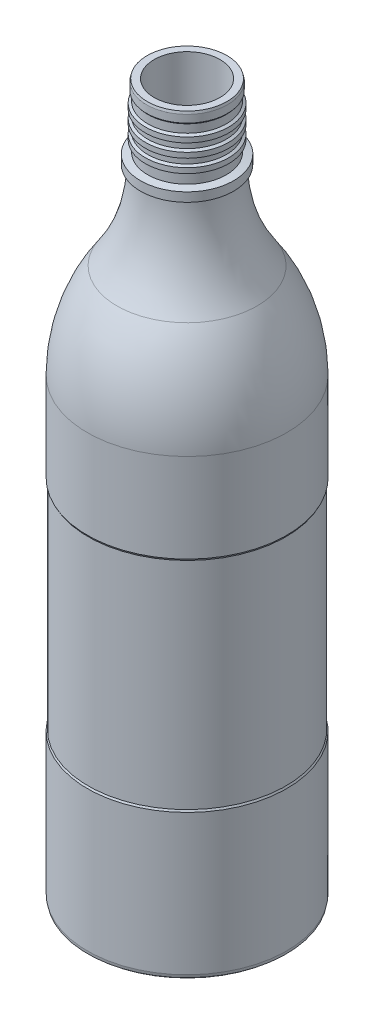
ISO-10303-21;
HEADER;
FILE_DESCRIPTION(('STEP AP214'),'2;1');
FILE_NAME('part.step','',(''),(''),'','','');
FILE_SCHEMA(('AUTOMOTIVE_DESIGN { 1 0 10303 214 1 1 1 1 }'));
ENDSEC;
DATA;
#1=APPLICATION_CONTEXT('core data for automotive mechanical design processes');
#2=APPLICATION_PROTOCOL_DEFINITION('international standard','automotive_design',2000,#1);
#3=PRODUCT_CONTEXT('',#1,'mechanical');
#4=PRODUCT('Part','Part','',(#3));
#5=PRODUCT_RELATED_PRODUCT_CATEGORY('part','',(#4));
#6=PRODUCT_DEFINITION_FORMATION('','',#4);
#7=PRODUCT_DEFINITION_CONTEXT('part definition',#1,'design');
#8=PRODUCT_DEFINITION('design','',#6,#7);
#9=PRODUCT_DEFINITION_SHAPE('','',#8);
#10=(LENGTH_UNIT() NAMED_UNIT(*) SI_UNIT(.MILLI.,.METRE.));
#11=(NAMED_UNIT(*) PLANE_ANGLE_UNIT() SI_UNIT($,.RADIAN.));
#12=(NAMED_UNIT(*) SI_UNIT($,.STERADIAN.) SOLID_ANGLE_UNIT());
#13=UNCERTAINTY_MEASURE_WITH_UNIT(LENGTH_MEASURE(1.E-05),#10,'distance_accuracy_value','');
#14=(GEOMETRIC_REPRESENTATION_CONTEXT(3) GLOBAL_UNCERTAINTY_ASSIGNED_CONTEXT((#13)) GLOBAL_UNIT_ASSIGNED_CONTEXT((#10,
#11,#12)) REPRESENTATION_CONTEXT('',''));
#15=CARTESIAN_POINT('',(0.,0.,0.));
#16=DIRECTION('',(0.,0.,1.));
#17=DIRECTION('',(1.,0.,0.));
#18=AXIS2_PLACEMENT_3D('',#15,#16,#17);
#19=CARTESIAN_POINT('',(0.,8.,0.));
#20=DIRECTION('',(0.,-1.,0.));
#21=DIRECTION('',(0.,0.,-1.));
#22=AXIS2_PLACEMENT_3D('',#19,#20,#21);
#23=PLANE('',#22);
#24=CARTESIAN_POINT('',(0.,8.,0.));
#25=DIRECTION('',(0.,-1.,0.));
#26=DIRECTION('',(0.,0.,-1.));
#27=AXIS2_PLACEMENT_3D('',#24,#25,#26);
#28=CIRCLE('',#27,21.);
#29=CARTESIAN_POINT('',(0.,8.,-21.));
#30=VERTEX_POINT('',#29);
#31=EDGE_CURVE('E10',#30,#30,#28,.T.);
#32=ORIENTED_EDGE('',*,*,#31,.T.);
#33=EDGE_LOOP('',(#32));
#34=FACE_BOUND('',#33,.T.);
#35=ADVANCED_FACE('F37',(#34),#23,.T.);
#36=CARTESIAN_POINT('',(0.,8.,0.));
#37=DIRECTION('',(0.,-1.,0.));
#38=DIRECTION('',(0.,0.,-1.));
#39=AXIS2_PLACEMENT_3D('',#36,#37,#38);
#40=CONICAL_SURFACE('',#39,21.,1.40101805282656);
#41=CARTESIAN_POINT('',(0.,7.4,0.));
#42=DIRECTION('',(0.,-1.,0.));
#43=DIRECTION('',(0.,0.,-1.));
#44=AXIS2_PLACEMENT_3D('',#41,#42,#43);
#45=CIRCLE('',#44,24.5);
#46=CARTESIAN_POINT('',(0.,7.4,-24.5));
#47=VERTEX_POINT('',#46);
#48=EDGE_CURVE('E43',#47,#47,#45,.T.);
#49=ORIENTED_EDGE('',*,*,#48,.T.);
#50=EDGE_LOOP('',(#49));
#51=FACE_BOUND('',#50,.T.);
#52=ORIENTED_EDGE('',*,*,#31,.F.);
#53=EDGE_LOOP('',(#52));
#54=FACE_BOUND('',#53,.T.);
#55=ADVANCED_FACE('F198',(#51,#54),#40,.F.);
#56=CARTESIAN_POINT('',(0.,7.4,0.));
#57=DIRECTION('',(0.,-1.,0.));
#58=DIRECTION('',(0.,0.,-1.));
#59=AXIS2_PLACEMENT_3D('',#56,#57,#58);
#60=CONICAL_SURFACE('',#59,24.5,0.896055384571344);
#61=CARTESIAN_POINT('',(0.,5.,0.));
#62=DIRECTION('',(0.,-1.,0.));
#63=DIRECTION('',(0.,0.,-1.));
#64=AXIS2_PLACEMENT_3D('',#61,#62,#63);
#65=CIRCLE('',#64,27.5);
#66=CARTESIAN_POINT('',(0.,5.,-27.5));
#67=VERTEX_POINT('',#66);
#68=EDGE_CURVE('E47',#67,#67,#65,.T.);
#69=ORIENTED_EDGE('',*,*,#68,.T.);
#70=EDGE_LOOP('',(#69));
#71=FACE_BOUND('',#70,.T.);
#72=ORIENTED_EDGE('',*,*,#48,.F.);
#73=EDGE_LOOP('',(#72));
#74=FACE_BOUND('',#73,.T.);
#75=ADVANCED_FACE('F202',(#71,#74),#60,.F.);
#76=CARTESIAN_POINT('',(0.,5.,0.));
#77=DIRECTION('',(0.,-1.,0.));
#78=DIRECTION('',(0.,0.,-1.));
#79=AXIS2_PLACEMENT_3D('',#76,#77,#78);
#80=CONICAL_SURFACE('',#79,27.5,0.375960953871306);
#81=CARTESIAN_POINT('',(0.,1.2,0.));
#82=DIRECTION('',(0.,-1.,0.));
#83=DIRECTION('',(0.,0.,-1.));
#84=AXIS2_PLACEMENT_3D('',#81,#82,#83);
#85=CIRCLE('',#84,29.);
#86=CARTESIAN_POINT('',(0.,1.2,-29.));
#87=VERTEX_POINT('',#86);
#88=EDGE_CURVE('E51',#87,#87,#85,.T.);
#89=ORIENTED_EDGE('',*,*,#88,.T.);
#90=EDGE_LOOP('',(#89));
#91=FACE_BOUND('',#90,.T.);
#92=ORIENTED_EDGE('',*,*,#68,.F.);
#93=EDGE_LOOP('',(#92));
#94=FACE_BOUND('',#93,.T.);
#95=ADVANCED_FACE('F206',(#91,#94),#80,.F.);
#96=CARTESIAN_POINT('',(0.,1.2,0.));
#97=DIRECTION('',(0.,-1.,0.));
#98=DIRECTION('',(0.,0.,-1.));
#99=AXIS2_PLACEMENT_3D('',#96,#97,#98);
#100=CONICAL_SURFACE('',#99,29.,0.896055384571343);
#101=CARTESIAN_POINT('',(0.,0.,0.));
#102=DIRECTION('',(0.,-1.,0.));
#103=DIRECTION('',(0.,0.,-1.));
#104=AXIS2_PLACEMENT_3D('',#101,#102,#103);
#105=CIRCLE('',#104,30.5);
#106=CARTESIAN_POINT('',(0.,0.,-30.5));
#107=VERTEX_POINT('',#106);
#108=EDGE_CURVE('E56',#107,#107,#105,.T.);
#109=ORIENTED_EDGE('',*,*,#108,.T.);
#110=EDGE_LOOP('',(#109));
#111=FACE_BOUND('',#110,.T.);
#112=ORIENTED_EDGE('',*,*,#88,.F.);
#113=EDGE_LOOP('',(#112));
#114=FACE_BOUND('',#113,.T.);
#115=ADVANCED_FACE('F213',(#111,#114),#100,.F.);
#116=CARTESIAN_POINT('',(30.5,0.,0.));
#117=DIRECTION('',(0.,-1.,0.));
#118=DIRECTION('',(0.,0.,-1.));
#119=AXIS2_PLACEMENT_3D('',#116,#117,#118);
#120=PLANE('',#119);
#121=CARTESIAN_POINT('',(0.,0.,0.));
#122=DIRECTION('',(0.,-1.,0.));
#123=DIRECTION('',(0.,0.,-1.));
#124=AXIS2_PLACEMENT_3D('',#121,#122,#123);
#125=CIRCLE('',#124,32.2);
#126=CARTESIAN_POINT('',(0.,0.,-32.2));
#127=VERTEX_POINT('',#126);
#128=EDGE_CURVE('E59',#127,#127,#125,.T.);
#129=ORIENTED_EDGE('',*,*,#128,.T.);
#130=EDGE_LOOP('',(#129));
#131=FACE_BOUND('',#130,.T.);
#132=ORIENTED_EDGE('',*,*,#108,.F.);
#133=EDGE_LOOP('',(#132));
#134=FACE_BOUND('',#133,.T.);
#135=ADVANCED_FACE('F217',(#131,#134),#120,.T.);
#136=CARTESIAN_POINT('',(0.,0.,0.));
#137=DIRECTION('',(0.,1.,0.));
#138=DIRECTION('',(0.,0.,1.));
#139=AXIS2_PLACEMENT_3D('',#136,#137,#138);
#140=CONICAL_SURFACE('',#139,32.2,0.87605805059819);
#141=CARTESIAN_POINT('',(0.,0.5,0.));
#142=DIRECTION('',(0.,-1.,0.));
#143=DIRECTION('',(0.,0.,-1.));
#144=AXIS2_PLACEMENT_3D('',#141,#142,#143);
#145=CIRCLE('',#144,32.8);
#146=CARTESIAN_POINT('',(0.,0.5,-32.8));
#147=VERTEX_POINT('',#146);
#148=EDGE_CURVE('E62',#147,#147,#145,.T.);
#149=ORIENTED_EDGE('',*,*,#148,.T.);
#150=EDGE_LOOP('',(#149));
#151=FACE_BOUND('',#150,.T.);
#152=ORIENTED_EDGE('',*,*,#128,.F.);
#153=EDGE_LOOP('',(#152));
#154=FACE_BOUND('',#153,.T.);
#155=ADVANCED_FACE('F221',(#151,#154),#140,.T.);
#156=CARTESIAN_POINT('',(0.,0.5,0.));
#157=DIRECTION('',(0.,1.,0.));
#158=DIRECTION('',(0.,0.,1.));
#159=AXIS2_PLACEMENT_3D('',#156,#157,#158);
#160=CONICAL_SURFACE('',#159,32.8,0.197395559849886);
#161=CARTESIAN_POINT('',(0.,1.5,0.));
#162=DIRECTION('',(0.,-1.,0.));
#163=DIRECTION('',(0.,0.,-1.));
#164=AXIS2_PLACEMENT_3D('',#161,#162,#163);
#165=CIRCLE('',#164,33.);
#166=CARTESIAN_POINT('',(0.,1.5,-33.));
#167=VERTEX_POINT('',#166);
#168=EDGE_CURVE('E65',#167,#167,#165,.T.);
#169=ORIENTED_EDGE('',*,*,#168,.T.);
#170=EDGE_LOOP('',(#169));
#171=FACE_BOUND('',#170,.T.);
#172=ORIENTED_EDGE('',*,*,#148,.F.);
#173=EDGE_LOOP('',(#172));
#174=FACE_BOUND('',#173,.T.);
#175=ADVANCED_FACE('F225',(#171,#174),#160,.T.);
#176=CARTESIAN_POINT('',(0.,-10.,0.));
#177=DIRECTION('',(0.,-1.,0.));
#178=DIRECTION('',(0.,0.,-1.));
#179=AXIS2_PLACEMENT_3D('',#176,#177,#178);
#180=CYLINDRICAL_SURFACE('',#179,33.);
#181=CARTESIAN_POINT('',(0.,48.,0.));
#182=DIRECTION('',(0.,-1.,0.));
#183=DIRECTION('',(0.,0.,-1.));
#184=AXIS2_PLACEMENT_3D('',#181,#182,#183);
#185=CIRCLE('',#184,33.);
#186=CARTESIAN_POINT('',(0.,48.,-33.));
#187=VERTEX_POINT('',#186);
#188=EDGE_CURVE('E68',#187,#187,#185,.T.);
#189=ORIENTED_EDGE('',*,*,#188,.T.);
#190=EDGE_LOOP('',(#189));
#191=FACE_BOUND('',#190,.T.);
#192=ORIENTED_EDGE('',*,*,#168,.F.);
#193=EDGE_LOOP('',(#192));
#194=FACE_BOUND('',#193,.T.);
#195=ADVANCED_FACE('F229',(#191,#194),#180,.T.);
#196=CARTESIAN_POINT('',(0.,48.,0.));
#197=DIRECTION('',(0.,-1.,0.));
#198=DIRECTION('',(0.,0.,-1.));
#199=AXIS2_PLACEMENT_3D('',#196,#197,#198);
#200=CONICAL_SURFACE('',#199,33.,0.463647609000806);
#201=CARTESIAN_POINT('',(0.,48.6,0.));
#202=DIRECTION('',(0.,-1.,0.));
#203=DIRECTION('',(0.,0.,-1.));
#204=AXIS2_PLACEMENT_3D('',#201,#202,#203);
#205=CIRCLE('',#204,32.7);
#206=CARTESIAN_POINT('',(0.,48.6,-32.7));
#207=VERTEX_POINT('',#206);
#208=EDGE_CURVE('E71',#207,#207,#205,.T.);
#209=ORIENTED_EDGE('',*,*,#208,.T.);
#210=EDGE_LOOP('',(#209));
#211=FACE_BOUND('',#210,.T.);
#212=ORIENTED_EDGE('',*,*,#188,.F.);
#213=EDGE_LOOP('',(#212));
#214=FACE_BOUND('',#213,.T.);
#215=ADVANCED_FACE('F233',(#211,#214),#200,.T.);
#216=CARTESIAN_POINT('',(0.,-10.,0.));
#217=DIRECTION('',(0.,-1.,0.));
#218=DIRECTION('',(0.,0.,-1.));
#219=AXIS2_PLACEMENT_3D('',#216,#217,#218);
#220=CYLINDRICAL_SURFACE('',#219,32.7);
#221=CARTESIAN_POINT('',(0.,120.,0.));
#222=DIRECTION('',(0.,-1.,0.));
#223=DIRECTION('',(0.,0.,-1.));
#224=AXIS2_PLACEMENT_3D('',#221,#222,#223);
#225=CIRCLE('',#224,32.7);
#226=CARTESIAN_POINT('',(0.,120.,-32.7));
#227=VERTEX_POINT('',#226);
#228=EDGE_CURVE('E74',#227,#227,#225,.T.);
#229=ORIENTED_EDGE('',*,*,#228,.T.);
#230=EDGE_LOOP('',(#229));
#231=FACE_BOUND('',#230,.T.);
#232=ORIENTED_EDGE('',*,*,#208,.F.);
#233=EDGE_LOOP('',(#232));
#234=FACE_BOUND('',#233,.T.);
#235=ADVANCED_FACE('F237',(#231,#234),#220,.T.);
#236=CARTESIAN_POINT('',(0.,120.,0.));
#237=DIRECTION('',(0.,1.,0.));
#238=DIRECTION('',(0.,0.,1.));
#239=AXIS2_PLACEMENT_3D('',#236,#237,#238);
#240=CONICAL_SURFACE('',#239,32.7,0.463647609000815);
#241=CARTESIAN_POINT('',(0.,120.6,0.));
#242=DIRECTION('',(0.,-1.,0.));
#243=DIRECTION('',(0.,0.,-1.));
#244=AXIS2_PLACEMENT_3D('',#241,#242,#243);
#245=CIRCLE('',#244,33.);
#246=CARTESIAN_POINT('',(0.,120.6,-33.));
#247=VERTEX_POINT('',#246);
#248=EDGE_CURVE('E77',#247,#247,#245,.T.);
#249=ORIENTED_EDGE('',*,*,#248,.T.);
#250=EDGE_LOOP('',(#249));
#251=FACE_BOUND('',#250,.T.);
#252=ORIENTED_EDGE('',*,*,#228,.F.);
#253=EDGE_LOOP('',(#252));
#254=FACE_BOUND('',#253,.T.);
#255=ADVANCED_FACE('F241',(#251,#254),#240,.T.);
#256=CARTESIAN_POINT('',(0.,-10.,0.));
#257=DIRECTION('',(0.,-1.,0.));
#258=DIRECTION('',(0.,0.,-1.));
#259=AXIS2_PLACEMENT_3D('',#256,#257,#258);
#260=CYLINDRICAL_SURFACE('',#259,33.);
#261=CARTESIAN_POINT('',(0.,150.,0.));
#262=DIRECTION('',(0.,-1.,0.));
#263=DIRECTION('',(0.,0.,-1.));
#264=AXIS2_PLACEMENT_3D('',#261,#262,#263);
#265=CIRCLE('',#264,33.);
#266=CARTESIAN_POINT('',(0.,150.,-33.));
#267=VERTEX_POINT('',#266);
#268=EDGE_CURVE('E80',#267,#267,#265,.T.);
#269=ORIENTED_EDGE('',*,*,#268,.T.);
#270=EDGE_LOOP('',(#269));
#271=FACE_BOUND('',#270,.T.);
#272=ORIENTED_EDGE('',*,*,#248,.F.);
#273=EDGE_LOOP('',(#272));
#274=FACE_BOUND('',#273,.T.);
#275=ADVANCED_FACE('F245',(#271,#274),#260,.T.);
#276=CARTESIAN_POINT('',(0.,150.,0.));
#277=DIRECTION('',(0.,-1.,0.));
#278=DIRECTION('',(0.,0.,-1.));
#279=AXIS2_PLACEMENT_3D('',#276,#277,#278);
#280=DEGENERATE_TOROIDAL_SURFACE('',#279,22.,55.,.F.);
#281=CARTESIAN_POINT('',(0.,181.385325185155,0.));
#282=DIRECTION('',(0.,-1.,0.));
#283=DIRECTION('',(0.,0.,-1.));
#284=AXIS2_PLACEMENT_3D('',#281,#282,#283);
#285=CIRCLE('',#284,23.1659314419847);
#286=CARTESIAN_POINT('',(0.,181.385325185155,-23.1659314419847));
#287=VERTEX_POINT('',#286);
#288=EDGE_CURVE('E83',#287,#287,#285,.T.);
#289=ORIENTED_EDGE('',*,*,#288,.T.);
#290=EDGE_LOOP('',(#289));
#291=FACE_BOUND('',#290,.T.);
#292=ORIENTED_EDGE('',*,*,#268,.F.);
#293=EDGE_LOOP('',(#292));
#294=FACE_BOUND('',#293,.T.);
#295=ADVANCED_FACE('F249',(#291,#294),#280,.F.);
#296=CARTESIAN_POINT('',(0.,210.,0.));
#297=DIRECTION('',(0.,-1.,0.));
#298=DIRECTION('',(0.,0.,-1.));
#299=AXIS2_PLACEMENT_3D('',#296,#297,#298);
#300=TOROIDAL_SURFACE('',#299,64.3446808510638,50.1446808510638);
#301=CARTESIAN_POINT('',(0.,210.,0.));
#302=DIRECTION('',(0.,-1.,0.));
#303=DIRECTION('',(0.,0.,-1.));
#304=AXIS2_PLACEMENT_3D('',#301,#302,#303);
#305=CIRCLE('',#304,14.2);
#306=CARTESIAN_POINT('',(0.,210.,-14.2));
#307=VERTEX_POINT('',#306);
#308=EDGE_CURVE('E86',#307,#307,#305,.T.);
#309=ORIENTED_EDGE('',*,*,#308,.T.);
#310=EDGE_LOOP('',(#309));
#311=FACE_BOUND('',#310,.T.);
#312=ORIENTED_EDGE('',*,*,#288,.F.);
#313=EDGE_LOOP('',(#312));
#314=FACE_BOUND('',#313,.T.);
#315=ADVANCED_FACE('F253',(#311,#314),#300,.F.);
#316=CARTESIAN_POINT('',(0.,210.,0.));
#317=DIRECTION('',(0.,1.,0.));
#318=DIRECTION('',(0.,0.,1.));
#319=AXIS2_PLACEMENT_3D('',#316,#317,#318);
#320=CONICAL_SURFACE('',#319,14.2,1.24904577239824);
#321=CARTESIAN_POINT('',(0.,210.4,0.));
#322=DIRECTION('',(0.,-1.,0.));
#323=DIRECTION('',(0.,0.,-1.));
#324=AXIS2_PLACEMENT_3D('',#321,#322,#323);
#325=CIRCLE('',#324,15.4);
#326=CARTESIAN_POINT('',(0.,210.4,-15.4));
#327=VERTEX_POINT('',#326);
#328=EDGE_CURVE('E89',#327,#327,#325,.T.);
#329=ORIENTED_EDGE('',*,*,#328,.T.);
#330=EDGE_LOOP('',(#329));
#331=FACE_BOUND('',#330,.T.);
#332=ORIENTED_EDGE('',*,*,#308,.F.);
#333=EDGE_LOOP('',(#332));
#334=FACE_BOUND('',#333,.T.);
#335=ADVANCED_FACE('F257',(#331,#334),#320,.T.);
#336=CARTESIAN_POINT('',(0.,-10.,0.));
#337=DIRECTION('',(0.,-1.,0.));
#338=DIRECTION('',(0.,0.,-1.));
#339=AXIS2_PLACEMENT_3D('',#336,#337,#338);
#340=CYLINDRICAL_SURFACE('',#339,15.4);
#341=CARTESIAN_POINT('',(0.,213.4,0.));
#342=DIRECTION('',(0.,-1.,0.));
#343=DIRECTION('',(0.,0.,-1.));
#344=AXIS2_PLACEMENT_3D('',#341,#342,#343);
#345=CIRCLE('',#344,15.4);
#346=CARTESIAN_POINT('',(0.,213.4,-15.4));
#347=VERTEX_POINT('',#346);
#348=EDGE_CURVE('E92',#347,#347,#345,.T.);
#349=ORIENTED_EDGE('',*,*,#348,.T.);
#350=EDGE_LOOP('',(#349));
#351=FACE_BOUND('',#350,.T.);
#352=ORIENTED_EDGE('',*,*,#328,.F.);
#353=EDGE_LOOP('',(#352));
#354=FACE_BOUND('',#353,.T.);
#355=ADVANCED_FACE('F261',(#351,#354),#340,.T.);
#356=CARTESIAN_POINT('',(0.,213.4,0.));
#357=DIRECTION('',(0.,-1.,0.));
#358=DIRECTION('',(0.,0.,-1.));
#359=AXIS2_PLACEMENT_3D('',#356,#357,#358);
#360=CONICAL_SURFACE('',#359,15.4,1.36540093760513);
#361=CARTESIAN_POINT('',(0.,213.9,0.));
#362=DIRECTION('',(0.,-1.,0.));
#363=DIRECTION('',(0.,0.,-1.));
#364=AXIS2_PLACEMENT_3D('',#361,#362,#363);
#365=CIRCLE('',#364,13.);
#366=CARTESIAN_POINT('',(0.,213.9,-13.));
#367=VERTEX_POINT('',#366);
#368=EDGE_CURVE('E95',#367,#367,#365,.T.);
#369=ORIENTED_EDGE('',*,*,#368,.T.);
#370=EDGE_LOOP('',(#369));
#371=FACE_BOUND('',#370,.T.);
#372=ORIENTED_EDGE('',*,*,#348,.F.);
#373=EDGE_LOOP('',(#372));
#374=FACE_BOUND('',#373,.T.);
#375=ADVANCED_FACE('F265',(#371,#374),#360,.T.);
#376=CARTESIAN_POINT('',(0.,-10.,0.));
#377=DIRECTION('',(0.,-1.,0.));
#378=DIRECTION('',(0.,0.,-1.));
#379=AXIS2_PLACEMENT_3D('',#376,#377,#378);
#380=CYLINDRICAL_SURFACE('',#379,13.);
#381=CARTESIAN_POINT('',(0.,217.,0.));
#382=DIRECTION('',(0.,-1.,0.));
#383=DIRECTION('',(0.,0.,-1.));
#384=AXIS2_PLACEMENT_3D('',#381,#382,#383);
#385=CIRCLE('',#384,13.);
#386=CARTESIAN_POINT('',(0.,217.,-13.));
#387=VERTEX_POINT('',#386);
#388=EDGE_CURVE('E98',#387,#387,#385,.T.);
#389=ORIENTED_EDGE('',*,*,#388,.T.);
#390=EDGE_LOOP('',(#389));
#391=FACE_BOUND('',#390,.T.);
#392=ORIENTED_EDGE('',*,*,#368,.F.);
#393=EDGE_LOOP('',(#392));
#394=FACE_BOUND('',#393,.T.);
#395=ADVANCED_FACE('F269',(#391,#394),#380,.T.);
#396=CARTESIAN_POINT('',(0.,217.,0.));
#397=DIRECTION('',(0.,1.,0.));
#398=DIRECTION('',(0.,0.,1.));
#399=AXIS2_PLACEMENT_3D('',#396,#397,#398);
#400=CONICAL_SURFACE('',#399,13.,1.01219701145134);
#401=CARTESIAN_POINT('',(0.,217.5,0.));
#402=DIRECTION('',(0.,-1.,0.));
#403=DIRECTION('',(0.,0.,-1.));
#404=AXIS2_PLACEMENT_3D('',#401,#402,#403);
#405=CIRCLE('',#404,13.8);
#406=CARTESIAN_POINT('',(0.,217.5,-13.8));
#407=VERTEX_POINT('',#406);
#408=EDGE_CURVE('E101',#407,#407,#405,.T.);
#409=ORIENTED_EDGE('',*,*,#408,.T.);
#410=EDGE_LOOP('',(#409));
#411=FACE_BOUND('',#410,.T.);
#412=ORIENTED_EDGE('',*,*,#388,.F.);
#413=EDGE_LOOP('',(#412));
#414=FACE_BOUND('',#413,.T.);
#415=ADVANCED_FACE('F273',(#411,#414),#400,.T.);
#416=CARTESIAN_POINT('',(0.,-10.,0.));
#417=DIRECTION('',(0.,-1.,0.));
#418=DIRECTION('',(0.,0.,-1.));
#419=AXIS2_PLACEMENT_3D('',#416,#417,#418);
#420=CYLINDRICAL_SURFACE('',#419,13.8);
#421=CARTESIAN_POINT('',(0.,219.2,0.));
#422=DIRECTION('',(0.,-1.,0.));
#423=DIRECTION('',(0.,0.,-1.));
#424=AXIS2_PLACEMENT_3D('',#421,#422,#423);
#425=CIRCLE('',#424,13.8);
#426=CARTESIAN_POINT('',(0.,219.2,-13.8));
#427=VERTEX_POINT('',#426);
#428=EDGE_CURVE('E104',#427,#427,#425,.T.);
#429=ORIENTED_EDGE('',*,*,#428,.T.);
#430=EDGE_LOOP('',(#429));
#431=FACE_BOUND('',#430,.T.);
#432=ORIENTED_EDGE('',*,*,#408,.F.);
#433=EDGE_LOOP('',(#432));
#434=FACE_BOUND('',#433,.T.);
#435=ADVANCED_FACE('F277',(#431,#434),#420,.T.);
#436=CARTESIAN_POINT('',(0.,219.2,0.));
#437=DIRECTION('',(0.,-1.,0.));
#438=DIRECTION('',(0.,0.,-1.));
#439=AXIS2_PLACEMENT_3D('',#436,#437,#438);
#440=CONICAL_SURFACE('',#439,13.8,1.01219701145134);
#441=CARTESIAN_POINT('',(0.,219.7,0.));
#442=DIRECTION('',(0.,-1.,0.));
#443=DIRECTION('',(0.,0.,-1.));
#444=AXIS2_PLACEMENT_3D('',#441,#442,#443);
#445=CIRCLE('',#444,13.);
#446=CARTESIAN_POINT('',(0.,219.7,-13.));
#447=VERTEX_POINT('',#446);
#448=EDGE_CURVE('E107',#447,#447,#445,.T.);
#449=ORIENTED_EDGE('',*,*,#448,.T.);
#450=EDGE_LOOP('',(#449));
#451=FACE_BOUND('',#450,.T.);
#452=ORIENTED_EDGE('',*,*,#428,.F.);
#453=EDGE_LOOP('',(#452));
#454=FACE_BOUND('',#453,.T.);
#455=ADVANCED_FACE('F281',(#451,#454),#440,.T.);
#456=CARTESIAN_POINT('',(0.,-10.,0.));
#457=DIRECTION('',(0.,-1.,0.));
#458=DIRECTION('',(0.,0.,-1.));
#459=AXIS2_PLACEMENT_3D('',#456,#457,#458);
#460=CYLINDRICAL_SURFACE('',#459,13.);
#461=CARTESIAN_POINT('',(0.,221.4,0.));
#462=DIRECTION('',(0.,-1.,0.));
#463=DIRECTION('',(0.,0.,-1.));
#464=AXIS2_PLACEMENT_3D('',#461,#462,#463);
#465=CIRCLE('',#464,13.);
#466=CARTESIAN_POINT('',(0.,221.4,-13.));
#467=VERTEX_POINT('',#466);
#468=EDGE_CURVE('E110',#467,#467,#465,.T.);
#469=ORIENTED_EDGE('',*,*,#468,.T.);
#470=EDGE_LOOP('',(#469));
#471=FACE_BOUND('',#470,.T.);
#472=ORIENTED_EDGE('',*,*,#448,.F.);
#473=EDGE_LOOP('',(#472));
#474=FACE_BOUND('',#473,.T.);
#475=ADVANCED_FACE('F285',(#471,#474),#460,.T.);
#476=CARTESIAN_POINT('',(0.,221.4,0.));
#477=DIRECTION('',(0.,1.,0.));
#478=DIRECTION('',(0.,0.,1.));
#479=AXIS2_PLACEMENT_3D('',#476,#477,#478);
#480=CONICAL_SURFACE('',#479,13.,1.01219701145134);
#481=CARTESIAN_POINT('',(0.,221.9,0.));
#482=DIRECTION('',(0.,-1.,0.));
#483=DIRECTION('',(0.,0.,-1.));
#484=AXIS2_PLACEMENT_3D('',#481,#482,#483);
#485=CIRCLE('',#484,13.8);
#486=CARTESIAN_POINT('',(0.,221.9,-13.8));
#487=VERTEX_POINT('',#486);
#488=EDGE_CURVE('E113',#487,#487,#485,.T.);
#489=ORIENTED_EDGE('',*,*,#488,.T.);
#490=EDGE_LOOP('',(#489));
#491=FACE_BOUND('',#490,.T.);
#492=ORIENTED_EDGE('',*,*,#468,.F.);
#493=EDGE_LOOP('',(#492));
#494=FACE_BOUND('',#493,.T.);
#495=ADVANCED_FACE('F289',(#491,#494),#480,.T.);
#496=CARTESIAN_POINT('',(0.,-10.,0.));
#497=DIRECTION('',(0.,-1.,0.));
#498=DIRECTION('',(0.,0.,-1.));
#499=AXIS2_PLACEMENT_3D('',#496,#497,#498);
#500=CYLINDRICAL_SURFACE('',#499,13.8);
#501=CARTESIAN_POINT('',(0.,223.6,0.));
#502=DIRECTION('',(0.,-1.,0.));
#503=DIRECTION('',(0.,0.,-1.));
#504=AXIS2_PLACEMENT_3D('',#501,#502,#503);
#505=CIRCLE('',#504,13.8);
#506=CARTESIAN_POINT('',(0.,223.6,-13.8));
#507=VERTEX_POINT('',#506);
#508=EDGE_CURVE('E116',#507,#507,#505,.T.);
#509=ORIENTED_EDGE('',*,*,#508,.T.);
#510=EDGE_LOOP('',(#509));
#511=FACE_BOUND('',#510,.T.);
#512=ORIENTED_EDGE('',*,*,#488,.F.);
#513=EDGE_LOOP('',(#512));
#514=FACE_BOUND('',#513,.T.);
#515=ADVANCED_FACE('F293',(#511,#514),#500,.T.);
#516=CARTESIAN_POINT('',(0.,223.6,0.));
#517=DIRECTION('',(0.,-1.,0.));
#518=DIRECTION('',(0.,0.,-1.));
#519=AXIS2_PLACEMENT_3D('',#516,#517,#518);
#520=CONICAL_SURFACE('',#519,13.8,1.01219701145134);
#521=CARTESIAN_POINT('',(0.,224.1,0.));
#522=DIRECTION('',(0.,-1.,0.));
#523=DIRECTION('',(0.,0.,-1.));
#524=AXIS2_PLACEMENT_3D('',#521,#522,#523);
#525=CIRCLE('',#524,13.);
#526=CARTESIAN_POINT('',(0.,224.1,-13.));
#527=VERTEX_POINT('',#526);
#528=EDGE_CURVE('E119',#527,#527,#525,.T.);
#529=ORIENTED_EDGE('',*,*,#528,.T.);
#530=EDGE_LOOP('',(#529));
#531=FACE_BOUND('',#530,.T.);
#532=ORIENTED_EDGE('',*,*,#508,.F.);
#533=EDGE_LOOP('',(#532));
#534=FACE_BOUND('',#533,.T.);
#535=ADVANCED_FACE('F297',(#531,#534),#520,.T.);
#536=CARTESIAN_POINT('',(0.,-10.,0.));
#537=DIRECTION('',(0.,-1.,0.));
#538=DIRECTION('',(0.,0.,-1.));
#539=AXIS2_PLACEMENT_3D('',#536,#537,#538);
#540=CYLINDRICAL_SURFACE('',#539,13.);
#541=CARTESIAN_POINT('',(0.,225.8,0.));
#542=DIRECTION('',(0.,-1.,0.));
#543=DIRECTION('',(0.,0.,-1.));
#544=AXIS2_PLACEMENT_3D('',#541,#542,#543);
#545=CIRCLE('',#544,13.);
#546=CARTESIAN_POINT('',(0.,225.8,-13.));
#547=VERTEX_POINT('',#546);
#548=EDGE_CURVE('E122',#547,#547,#545,.T.);
#549=ORIENTED_EDGE('',*,*,#548,.T.);
#550=EDGE_LOOP('',(#549));
#551=FACE_BOUND('',#550,.T.);
#552=ORIENTED_EDGE('',*,*,#528,.F.);
#553=EDGE_LOOP('',(#552));
#554=FACE_BOUND('',#553,.T.);
#555=ADVANCED_FACE('F301',(#551,#554),#540,.T.);
#556=CARTESIAN_POINT('',(0.,225.8,0.));
#557=DIRECTION('',(0.,1.,0.));
#558=DIRECTION('',(0.,0.,1.));
#559=AXIS2_PLACEMENT_3D('',#556,#557,#558);
#560=CONICAL_SURFACE('',#559,13.,1.01219701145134);
#561=CARTESIAN_POINT('',(0.,226.3,0.));
#562=DIRECTION('',(0.,-1.,0.));
#563=DIRECTION('',(0.,0.,-1.));
#564=AXIS2_PLACEMENT_3D('',#561,#562,#563);
#565=CIRCLE('',#564,13.8);
#566=CARTESIAN_POINT('',(0.,226.3,-13.8));
#567=VERTEX_POINT('',#566);
#568=EDGE_CURVE('E125',#567,#567,#565,.T.);
#569=ORIENTED_EDGE('',*,*,#568,.T.);
#570=EDGE_LOOP('',(#569));
#571=FACE_BOUND('',#570,.T.);
#572=ORIENTED_EDGE('',*,*,#548,.F.);
#573=EDGE_LOOP('',(#572));
#574=FACE_BOUND('',#573,.T.);
#575=ADVANCED_FACE('F305',(#571,#574),#560,.T.);
#576=CARTESIAN_POINT('',(0.,-10.,0.));
#577=DIRECTION('',(0.,-1.,0.));
#578=DIRECTION('',(0.,0.,-1.));
#579=AXIS2_PLACEMENT_3D('',#576,#577,#578);
#580=CYLINDRICAL_SURFACE('',#579,13.8);
#581=CARTESIAN_POINT('',(0.,228.,0.));
#582=DIRECTION('',(0.,-1.,0.));
#583=DIRECTION('',(0.,0.,-1.));
#584=AXIS2_PLACEMENT_3D('',#581,#582,#583);
#585=CIRCLE('',#584,13.8);
#586=CARTESIAN_POINT('',(0.,228.,-13.8));
#587=VERTEX_POINT('',#586);
#588=EDGE_CURVE('E128',#587,#587,#585,.T.);
#589=ORIENTED_EDGE('',*,*,#588,.T.);
#590=EDGE_LOOP('',(#589));
#591=FACE_BOUND('',#590,.T.);
#592=ORIENTED_EDGE('',*,*,#568,.F.);
#593=EDGE_LOOP('',(#592));
#594=FACE_BOUND('',#593,.T.);
#595=ADVANCED_FACE('F309',(#591,#594),#580,.T.);
#596=CARTESIAN_POINT('',(0.,228.,0.));
#597=DIRECTION('',(0.,-1.,0.));
#598=DIRECTION('',(0.,0.,-1.));
#599=AXIS2_PLACEMENT_3D('',#596,#597,#598);
#600=CONICAL_SURFACE('',#599,13.8,1.01219701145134);
#601=CARTESIAN_POINT('',(0.,228.5,0.));
#602=DIRECTION('',(0.,-1.,0.));
#603=DIRECTION('',(0.,0.,-1.));
#604=AXIS2_PLACEMENT_3D('',#601,#602,#603);
#605=CIRCLE('',#604,13.);
#606=CARTESIAN_POINT('',(0.,228.5,-13.));
#607=VERTEX_POINT('',#606);
#608=EDGE_CURVE('E131',#607,#607,#605,.T.);
#609=ORIENTED_EDGE('',*,*,#608,.T.);
#610=EDGE_LOOP('',(#609));
#611=FACE_BOUND('',#610,.T.);
#612=ORIENTED_EDGE('',*,*,#588,.F.);
#613=EDGE_LOOP('',(#612));
#614=FACE_BOUND('',#613,.T.);
#615=ADVANCED_FACE('F313',(#611,#614),#600,.T.);
#616=CARTESIAN_POINT('',(0.,-10.,0.));
#617=DIRECTION('',(0.,-1.,0.));
#618=DIRECTION('',(0.,0.,-1.));
#619=AXIS2_PLACEMENT_3D('',#616,#617,#618);
#620=CYLINDRICAL_SURFACE('',#619,13.);
#621=CARTESIAN_POINT('',(0.,231.2,0.));
#622=DIRECTION('',(0.,-1.,0.));
#623=DIRECTION('',(0.,0.,-1.));
#624=AXIS2_PLACEMENT_3D('',#621,#622,#623);
#625=CIRCLE('',#624,13.);
#626=CARTESIAN_POINT('',(0.,231.2,-13.));
#627=VERTEX_POINT('',#626);
#628=EDGE_CURVE('E134',#627,#627,#625,.T.);
#629=ORIENTED_EDGE('',*,*,#628,.T.);
#630=EDGE_LOOP('',(#629));
#631=FACE_BOUND('',#630,.T.);
#632=ORIENTED_EDGE('',*,*,#608,.F.);
#633=EDGE_LOOP('',(#632));
#634=FACE_BOUND('',#633,.T.);
#635=ADVANCED_FACE('F317',(#631,#634),#620,.T.);
#636=CARTESIAN_POINT('',(0.,231.2,0.));
#637=DIRECTION('',(0.,1.,0.));
#638=DIRECTION('',(0.,0.,1.));
#639=AXIS2_PLACEMENT_3D('',#636,#637,#638);
#640=CONICAL_SURFACE('',#639,13.,0.674740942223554);
#641=CARTESIAN_POINT('',(0.,231.7,0.));
#642=DIRECTION('',(0.,-1.,0.));
#643=DIRECTION('',(0.,0.,-1.));
#644=AXIS2_PLACEMENT_3D('',#641,#642,#643);
#645=CIRCLE('',#644,13.4);
#646=CARTESIAN_POINT('',(0.,231.7,-13.4));
#647=VERTEX_POINT('',#646);
#648=EDGE_CURVE('E137',#647,#647,#645,.T.);
#649=ORIENTED_EDGE('',*,*,#648,.T.);
#650=EDGE_LOOP('',(#649));
#651=FACE_BOUND('',#650,.T.);
#652=ORIENTED_EDGE('',*,*,#628,.F.);
#653=EDGE_LOOP('',(#652));
#654=FACE_BOUND('',#653,.T.);
#655=ADVANCED_FACE('F321',(#651,#654),#640,.T.);
#656=CARTESIAN_POINT('',(0.,-10.,0.));
#657=DIRECTION('',(0.,-1.,0.));
#658=DIRECTION('',(0.,0.,-1.));
#659=AXIS2_PLACEMENT_3D('',#656,#657,#658);
#660=CYLINDRICAL_SURFACE('',#659,13.4);
#661=CARTESIAN_POINT('',(0.,234.2,0.));
#662=DIRECTION('',(0.,-1.,0.));
#663=DIRECTION('',(0.,0.,-1.));
#664=AXIS2_PLACEMENT_3D('',#661,#662,#663);
#665=CIRCLE('',#664,13.4);
#666=CARTESIAN_POINT('',(0.,234.2,-13.4));
#667=VERTEX_POINT('',#666);
#668=EDGE_CURVE('E140',#667,#667,#665,.T.);
#669=ORIENTED_EDGE('',*,*,#668,.T.);
#670=EDGE_LOOP('',(#669));
#671=FACE_BOUND('',#670,.T.);
#672=ORIENTED_EDGE('',*,*,#648,.F.);
#673=EDGE_LOOP('',(#672));
#674=FACE_BOUND('',#673,.T.);
#675=ADVANCED_FACE('F325',(#671,#674),#660,.T.);
#676=CARTESIAN_POINT('',(0.,234.2,0.));
#677=DIRECTION('',(0.,-1.,0.));
#678=DIRECTION('',(0.,0.,-1.));
#679=AXIS2_PLACEMENT_3D('',#676,#677,#678);
#680=CONICAL_SURFACE('',#679,13.4,0.244978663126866);
#681=CARTESIAN_POINT('',(0.,235.,0.));
#682=DIRECTION('',(0.,-1.,0.));
#683=DIRECTION('',(0.,0.,-1.));
#684=AXIS2_PLACEMENT_3D('',#681,#682,#683);
#685=CIRCLE('',#684,13.2);
#686=CARTESIAN_POINT('',(0.,235.,-13.2));
#687=VERTEX_POINT('',#686);
#688=EDGE_CURVE('E143',#687,#687,#685,.T.);
#689=ORIENTED_EDGE('',*,*,#688,.T.);
#690=EDGE_LOOP('',(#689));
#691=FACE_BOUND('',#690,.T.);
#692=ORIENTED_EDGE('',*,*,#668,.F.);
#693=EDGE_LOOP('',(#692));
#694=FACE_BOUND('',#693,.T.);
#695=ADVANCED_FACE('F329',(#691,#694),#680,.T.);
#696=CARTESIAN_POINT('',(13.2,235.,0.));
#697=DIRECTION('',(0.,1.,0.));
#698=DIRECTION('',(0.,0.,1.));
#699=AXIS2_PLACEMENT_3D('',#696,#697,#698);
#700=PLANE('',#699);
#701=CARTESIAN_POINT('',(0.,235.,0.));
#702=DIRECTION('',(0.,-1.,0.));
#703=DIRECTION('',(0.,0.,-1.));
#704=AXIS2_PLACEMENT_3D('',#701,#702,#703);
#705=CIRCLE('',#704,10.9);
#706=CARTESIAN_POINT('',(0.,235.,-10.9));
#707=VERTEX_POINT('',#706);
#708=EDGE_CURVE('E146',#707,#707,#705,.T.);
#709=ORIENTED_EDGE('',*,*,#708,.T.);
#710=EDGE_LOOP('',(#709));
#711=FACE_BOUND('',#710,.T.);
#712=ORIENTED_EDGE('',*,*,#688,.F.);
#713=EDGE_LOOP('',(#712));
#714=FACE_BOUND('',#713,.T.);
#715=ADVANCED_FACE('F333',(#711,#714),#700,.T.);
#716=CARTESIAN_POINT('',(0.,-10.,0.));
#717=DIRECTION('',(0.,-1.,0.));
#718=DIRECTION('',(0.,0.,-1.));
#719=AXIS2_PLACEMENT_3D('',#716,#717,#718);
#720=CYLINDRICAL_SURFACE('',#719,10.9);
#721=CARTESIAN_POINT('',(0.,211.2,0.));
#722=DIRECTION('',(0.,-1.,0.));
#723=DIRECTION('',(0.,0.,-1.));
#724=AXIS2_PLACEMENT_3D('',#721,#722,#723);
#725=CIRCLE('',#724,10.9);
#726=CARTESIAN_POINT('',(0.,211.2,-10.9));
#727=VERTEX_POINT('',#726);
#728=EDGE_CURVE('E149',#727,#727,#725,.T.);
#729=ORIENTED_EDGE('',*,*,#728,.T.);
#730=EDGE_LOOP('',(#729));
#731=FACE_BOUND('',#730,.T.);
#732=ORIENTED_EDGE('',*,*,#708,.F.);
#733=EDGE_LOOP('',(#732));
#734=FACE_BOUND('',#733,.T.);
#735=ADVANCED_FACE('F337',(#731,#734),#720,.F.);
#736=CARTESIAN_POINT('',(0.,211.2,0.));
#737=DIRECTION('',(0.,-1.,0.));
#738=DIRECTION('',(0.,0.,-1.));
#739=AXIS2_PLACEMENT_3D('',#736,#737,#738);
#740=TOROIDAL_SURFACE('',#739,56.0570422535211,45.1570422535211);
#741=CARTESIAN_POINT('',(0.,182.726831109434,0.));
#742=DIRECTION('',(0.,-1.,0.));
#743=DIRECTION('',(0.,0.,-1.));
#744=AXIS2_PLACEMENT_3D('',#741,#742,#743);
#745=CIRCLE('',#744,21.0079749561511);
#746=CARTESIAN_POINT('',(0.,182.726831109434,-21.0079749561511));
#747=VERTEX_POINT('',#746);
#748=EDGE_CURVE('E152',#747,#747,#745,.T.);
#749=ORIENTED_EDGE('',*,*,#748,.T.);
#750=EDGE_LOOP('',(#749));
#751=FACE_BOUND('',#750,.T.);
#752=ORIENTED_EDGE('',*,*,#728,.F.);
#753=EDGE_LOOP('',(#752));
#754=FACE_BOUND('',#753,.T.);
#755=ADVANCED_FACE('F341',(#751,#754),#740,.T.);
#756=CARTESIAN_POINT('',(0.,151.2,0.));
#757=DIRECTION('',(0.,-1.,0.));
#758=DIRECTION('',(0.,0.,-1.));
#759=AXIS2_PLACEMENT_3D('',#756,#757,#758);
#760=DEGENERATE_TOROIDAL_SURFACE('',#759,17.8,50.,.F.);
#761=CARTESIAN_POINT('',(0.,151.2,0.));
#762=DIRECTION('',(0.,-1.,0.));
#763=DIRECTION('',(0.,0.,-1.));
#764=AXIS2_PLACEMENT_3D('',#761,#762,#763);
#765=CIRCLE('',#764,32.2);
#766=CARTESIAN_POINT('',(0.,151.2,-32.2));
#767=VERTEX_POINT('',#766);
#768=EDGE_CURVE('E155',#767,#767,#765,.T.);
#769=ORIENTED_EDGE('',*,*,#768,.T.);
#770=EDGE_LOOP('',(#769));
#771=FACE_BOUND('',#770,.T.);
#772=ORIENTED_EDGE('',*,*,#748,.F.);
#773=EDGE_LOOP('',(#772));
#774=FACE_BOUND('',#773,.T.);
#775=ADVANCED_FACE('F345',(#771,#774),#760,.T.);
#776=CARTESIAN_POINT('',(0.,-10.,0.));
#777=DIRECTION('',(0.,-1.,0.));
#778=DIRECTION('',(0.,0.,-1.));
#779=AXIS2_PLACEMENT_3D('',#776,#777,#778);
#780=CYLINDRICAL_SURFACE('',#779,32.2);
#781=CARTESIAN_POINT('',(0.,120.,0.));
#782=DIRECTION('',(0.,-1.,0.));
#783=DIRECTION('',(0.,0.,-1.));
#784=AXIS2_PLACEMENT_3D('',#781,#782,#783);
#785=CIRCLE('',#784,32.2);
#786=CARTESIAN_POINT('',(0.,120.,-32.2));
#787=VERTEX_POINT('',#786);
#788=EDGE_CURVE('E158',#787,#787,#785,.T.);
#789=ORIENTED_EDGE('',*,*,#788,.T.);
#790=EDGE_LOOP('',(#789));
#791=FACE_BOUND('',#790,.T.);
#792=ORIENTED_EDGE('',*,*,#768,.F.);
#793=EDGE_LOOP('',(#792));
#794=FACE_BOUND('',#793,.T.);
#795=ADVANCED_FACE('F349',(#791,#794),#780,.F.);
#796=CARTESIAN_POINT('',(0.,120.,0.));
#797=DIRECTION('',(0.,1.,0.));
#798=DIRECTION('',(0.,0.,1.));
#799=AXIS2_PLACEMENT_3D('',#796,#797,#798);
#800=CONICAL_SURFACE('',#799,32.2,0.463647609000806);
#801=CARTESIAN_POINT('',(0.,119.4,0.));
#802=DIRECTION('',(0.,-1.,0.));
#803=DIRECTION('',(0.,0.,-1.));
#804=AXIS2_PLACEMENT_3D('',#801,#802,#803);
#805=CIRCLE('',#804,31.9);
#806=CARTESIAN_POINT('',(0.,119.4,-31.9));
#807=VERTEX_POINT('',#806);
#808=EDGE_CURVE('E161',#807,#807,#805,.T.);
#809=ORIENTED_EDGE('',*,*,#808,.T.);
#810=EDGE_LOOP('',(#809));
#811=FACE_BOUND('',#810,.T.);
#812=ORIENTED_EDGE('',*,*,#788,.F.);
#813=EDGE_LOOP('',(#812));
#814=FACE_BOUND('',#813,.T.);
#815=ADVANCED_FACE('F353',(#811,#814),#800,.F.);
#816=CARTESIAN_POINT('',(0.,-10.,0.));
#817=DIRECTION('',(0.,-1.,0.));
#818=DIRECTION('',(0.,0.,-1.));
#819=AXIS2_PLACEMENT_3D('',#816,#817,#818);
#820=CYLINDRICAL_SURFACE('',#819,31.9);
#821=CARTESIAN_POINT('',(0.,48.6,0.));
#822=DIRECTION('',(0.,-1.,0.));
#823=DIRECTION('',(0.,0.,-1.));
#824=AXIS2_PLACEMENT_3D('',#821,#822,#823);
#825=CIRCLE('',#824,31.9);
#826=CARTESIAN_POINT('',(0.,48.6,-31.9));
#827=VERTEX_POINT('',#826);
#828=EDGE_CURVE('E164',#827,#827,#825,.T.);
#829=ORIENTED_EDGE('',*,*,#828,.T.);
#830=EDGE_LOOP('',(#829));
#831=FACE_BOUND('',#830,.T.);
#832=ORIENTED_EDGE('',*,*,#808,.F.);
#833=EDGE_LOOP('',(#832));
#834=FACE_BOUND('',#833,.T.);
#835=ADVANCED_FACE('F357',(#831,#834),#820,.F.);
#836=CARTESIAN_POINT('',(0.,48.6,0.));
#837=DIRECTION('',(0.,-1.,0.));
#838=DIRECTION('',(0.,0.,-1.));
#839=AXIS2_PLACEMENT_3D('',#836,#837,#838);
#840=CONICAL_SURFACE('',#839,31.9,0.463647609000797);
#841=CARTESIAN_POINT('',(0.,48.,0.));
#842=DIRECTION('',(0.,-1.,0.));
#843=DIRECTION('',(0.,0.,-1.));
#844=AXIS2_PLACEMENT_3D('',#841,#842,#843);
#845=CIRCLE('',#844,32.2);
#846=CARTESIAN_POINT('',(0.,48.,-32.2));
#847=VERTEX_POINT('',#846);
#848=EDGE_CURVE('E167',#847,#847,#845,.T.);
#849=ORIENTED_EDGE('',*,*,#848,.T.);
#850=EDGE_LOOP('',(#849));
#851=FACE_BOUND('',#850,.T.);
#852=ORIENTED_EDGE('',*,*,#828,.F.);
#853=EDGE_LOOP('',(#852));
#854=FACE_BOUND('',#853,.T.);
#855=ADVANCED_FACE('F361',(#851,#854),#840,.F.);
#856=CARTESIAN_POINT('',(0.,-10.,0.));
#857=DIRECTION('',(0.,-1.,0.));
#858=DIRECTION('',(0.,0.,-1.));
#859=AXIS2_PLACEMENT_3D('',#856,#857,#858);
#860=CYLINDRICAL_SURFACE('',#859,32.2);
#861=CARTESIAN_POINT('',(0.,12.,0.));
#862=DIRECTION('',(0.,-1.,0.));
#863=DIRECTION('',(0.,0.,-1.));
#864=AXIS2_PLACEMENT_3D('',#861,#862,#863);
#865=CIRCLE('',#864,32.2);
#866=CARTESIAN_POINT('',(0.,12.,-32.2));
#867=VERTEX_POINT('',#866);
#868=EDGE_CURVE('E170',#867,#867,#865,.T.);
#869=ORIENTED_EDGE('',*,*,#868,.T.);
#870=EDGE_LOOP('',(#869));
#871=FACE_BOUND('',#870,.T.);
#872=ORIENTED_EDGE('',*,*,#848,.F.);
#873=EDGE_LOOP('',(#872));
#874=FACE_BOUND('',#873,.T.);
#875=ADVANCED_FACE('F365',(#871,#874),#860,.F.);
#876=CARTESIAN_POINT('',(0.,12.,0.));
#877=DIRECTION('',(0.,1.,0.));
#878=DIRECTION('',(0.,0.,1.));
#879=AXIS2_PLACEMENT_3D('',#876,#877,#878);
#880=CONICAL_SURFACE('',#879,32.2,0.463647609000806);
#881=CARTESIAN_POINT('',(0.,10.6,0.));
#882=DIRECTION('',(0.,-1.,0.));
#883=DIRECTION('',(0.,0.,-1.));
#884=AXIS2_PLACEMENT_3D('',#881,#882,#883);
#885=CIRCLE('',#884,31.5);
#886=CARTESIAN_POINT('',(0.,10.6,-31.5));
#887=VERTEX_POINT('',#886);
#888=EDGE_CURVE('E173',#887,#887,#885,.T.);
#889=ORIENTED_EDGE('',*,*,#888,.T.);
#890=EDGE_LOOP('',(#889));
#891=FACE_BOUND('',#890,.T.);
#892=ORIENTED_EDGE('',*,*,#868,.F.);
#893=EDGE_LOOP('',(#892));
#894=FACE_BOUND('',#893,.T.);
#895=ADVANCED_FACE('F369',(#891,#894),#880,.F.);
#896=CARTESIAN_POINT('',(0.,10.6,0.));
#897=DIRECTION('',(0.,1.,0.));
#898=DIRECTION('',(0.,0.,1.));
#899=AXIS2_PLACEMENT_3D('',#896,#897,#898);
#900=CONICAL_SURFACE('',#899,31.5,0.982793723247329);
#901=CARTESIAN_POINT('',(0.,9.6,0.));
#902=DIRECTION('',(0.,-1.,0.));
#903=DIRECTION('',(0.,0.,-1.));
#904=AXIS2_PLACEMENT_3D('',#901,#902,#903);
#905=CIRCLE('',#904,30.);
#906=CARTESIAN_POINT('',(0.,9.6,-30.));
#907=VERTEX_POINT('',#906);
#908=EDGE_CURVE('E176',#907,#907,#905,.T.);
#909=ORIENTED_EDGE('',*,*,#908,.T.);
#910=EDGE_LOOP('',(#909));
#911=FACE_BOUND('',#910,.T.);
#912=ORIENTED_EDGE('',*,*,#888,.F.);
#913=EDGE_LOOP('',(#912));
#914=FACE_BOUND('',#913,.T.);
#915=ADVANCED_FACE('F373',(#911,#914),#900,.F.);
#916=CARTESIAN_POINT('',(0.,9.6,0.));
#917=DIRECTION('',(0.,1.,0.));
#918=DIRECTION('',(0.,0.,1.));
#919=AXIS2_PLACEMENT_3D('',#916,#917,#918);
#920=CONICAL_SURFACE('',#919,30.,1.27933953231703);
#921=CARTESIAN_POINT('',(0.,9.,0.));
#922=DIRECTION('',(0.,-1.,0.));
#923=DIRECTION('',(0.,0.,-1.));
#924=AXIS2_PLACEMENT_3D('',#921,#922,#923);
#925=CIRCLE('',#924,28.);
#926=CARTESIAN_POINT('',(0.,9.,-28.));
#927=VERTEX_POINT('',#926);
#928=EDGE_CURVE('E179',#927,#927,#925,.T.);
#929=ORIENTED_EDGE('',*,*,#928,.T.);
#930=EDGE_LOOP('',(#929));
#931=FACE_BOUND('',#930,.T.);
#932=ORIENTED_EDGE('',*,*,#908,.F.);
#933=EDGE_LOOP('',(#932));
#934=FACE_BOUND('',#933,.T.);
#935=ADVANCED_FACE('F195',(#931,#934),#920,.F.);
#936=CARTESIAN_POINT('',(0.,9.,0.));
#937=DIRECTION('',(0.,1.,0.));
#938=DIRECTION('',(0.,0.,1.));
#939=AXIS2_PLACEMENT_3D('',#936,#937,#938);
#940=CONICAL_SURFACE('',#939,28.,1.50422816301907);
#941=CARTESIAN_POINT('',(0.,8.8,0.));
#942=DIRECTION('',(0.,-1.,0.));
#943=DIRECTION('',(0.,0.,-1.));
#944=AXIS2_PLACEMENT_3D('',#941,#942,#943);
#945=CIRCLE('',#944,25.);
#946=CARTESIAN_POINT('',(0.,8.8,-25.));
#947=VERTEX_POINT('',#946);
#948=EDGE_CURVE('E182',#947,#947,#945,.T.);
#949=ORIENTED_EDGE('',*,*,#948,.T.);
#950=EDGE_LOOP('',(#949));
#951=FACE_BOUND('',#950,.T.);
#952=ORIENTED_EDGE('',*,*,#928,.F.);
#953=EDGE_LOOP('',(#952));
#954=FACE_BOUND('',#953,.T.);
#955=ADVANCED_FACE('F186',(#951,#954),#940,.F.);
#956=CARTESIAN_POINT('',(25.,8.8,0.));
#957=DIRECTION('',(0.,1.,0.));
#958=DIRECTION('',(0.,0.,1.));
#959=AXIS2_PLACEMENT_3D('',#956,#957,#958);
#960=PLANE('',#959);
#961=ORIENTED_EDGE('',*,*,#948,.F.);
#962=EDGE_LOOP('',(#961));
#963=FACE_BOUND('',#962,.T.);
#964=ADVANCED_FACE('F189',(#963),#960,.T.);
#965=CLOSED_SHELL('',(#35,#55,#75,#95,#115,#135,#155,#175,#195,#215,#235,#255,#275,#295,#315,
#335,#355,#375,#395,#415,#435,#455,#475,#495,#515,#535,#555,#575,#595,#615,#635,#655,#675,#695,
#715,#735,#755,#775,#795,#815,#835,#855,#875,#895,#915,#935,#955,#964));
#966=MANIFOLD_SOLID_BREP('B2',#965);
#967=ADVANCED_BREP_SHAPE_REPRESENTATION('',(#18,#966),#14);
#968=SHAPE_DEFINITION_REPRESENTATION(#9,#967);
ENDSEC;
END-ISO-10303-21;
